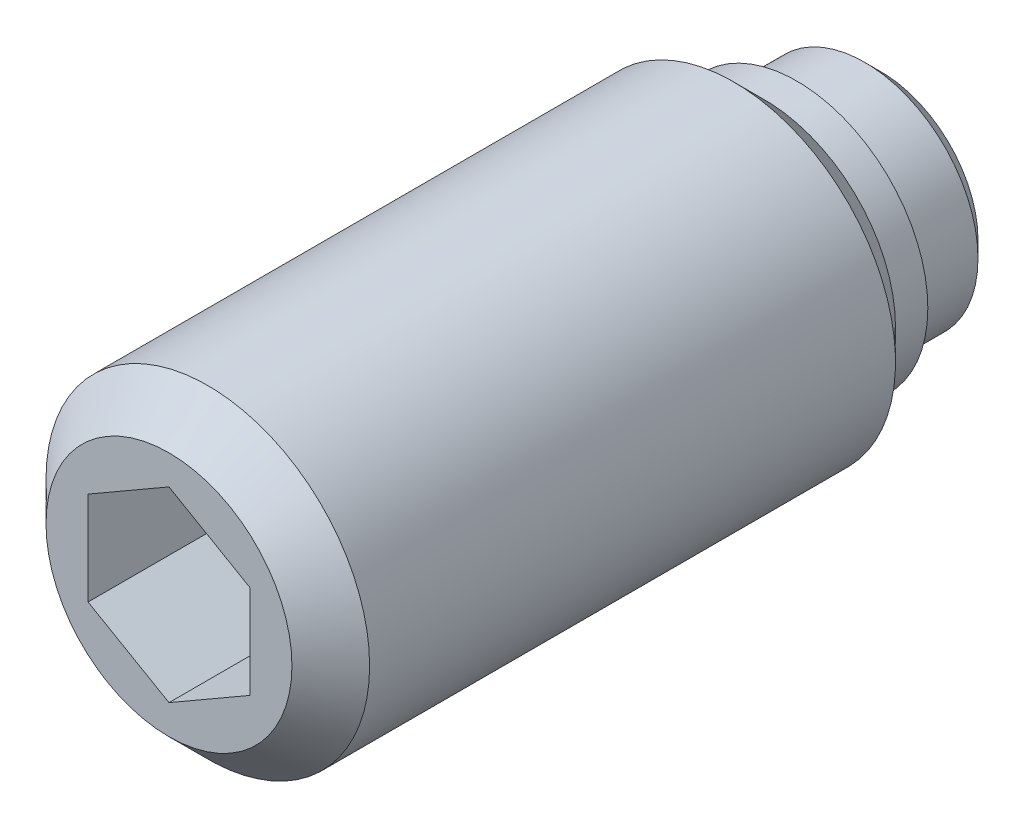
ISO-10303-21;
HEADER;
FILE_DESCRIPTION(('STEP AP214'),'2;1');
FILE_NAME('part.step','',(''),(''),'','','');
FILE_SCHEMA(('AUTOMOTIVE_DESIGN { 1 0 10303 214 1 1 1 1 }'));
ENDSEC;
DATA;
#1=APPLICATION_CONTEXT('core data for automotive mechanical design processes');
#2=APPLICATION_PROTOCOL_DEFINITION('international standard','automotive_design',2000,#1);
#3=PRODUCT_CONTEXT('',#1,'mechanical');
#4=PRODUCT('Part','Part','',(#3));
#5=PRODUCT_RELATED_PRODUCT_CATEGORY('part','',(#4));
#6=PRODUCT_DEFINITION_FORMATION('','',#4);
#7=PRODUCT_DEFINITION_CONTEXT('part definition',#1,'design');
#8=PRODUCT_DEFINITION('design','',#6,#7);
#9=PRODUCT_DEFINITION_SHAPE('','',#8);
#10=(LENGTH_UNIT() NAMED_UNIT(*) SI_UNIT(.MILLI.,.METRE.));
#11=(NAMED_UNIT(*) PLANE_ANGLE_UNIT() SI_UNIT($,.RADIAN.));
#12=(NAMED_UNIT(*) SI_UNIT($,.STERADIAN.) SOLID_ANGLE_UNIT());
#13=UNCERTAINTY_MEASURE_WITH_UNIT(LENGTH_MEASURE(1.E-05),#10,'distance_accuracy_value','');
#14=(GEOMETRIC_REPRESENTATION_CONTEXT(3) GLOBAL_UNCERTAINTY_ASSIGNED_CONTEXT((#13)) GLOBAL_UNIT_ASSIGNED_CONTEXT((#10,
#11,#12)) REPRESENTATION_CONTEXT('',''));
#15=CARTESIAN_POINT('',(0.,0.,0.));
#16=DIRECTION('',(0.,0.,1.));
#17=DIRECTION('',(1.,0.,0.));
#18=AXIS2_PLACEMENT_3D('',#15,#16,#17);
#19=CARTESIAN_POINT('',(0.,0.,2.6));
#20=DIRECTION('',(0.,0.,-1.));
#21=DIRECTION('',(-1.,0.,0.));
#22=AXIS2_PLACEMENT_3D('',#19,#20,#21);
#23=CYLINDRICAL_SURFACE('',#22,5.);
#24=CARTESIAN_POINT('',(0.,0.,20.8));
#25=DIRECTION('',(0.,0.,1.));
#26=DIRECTION('',(1.,0.,0.));
#27=AXIS2_PLACEMENT_3D('',#24,#25,#26);
#28=CIRCLE('',#27,5.);
#29=CARTESIAN_POINT('',(5.,0.,20.8));
#30=VERTEX_POINT('',#29);
#31=EDGE_CURVE('E9',#30,#30,#28,.F.);
#32=ORIENTED_EDGE('',*,*,#31,.T.);
#33=EDGE_LOOP('',(#32));
#34=FACE_BOUND('',#33,.T.);
#35=CARTESIAN_POINT('',(0.,0.,4.55));
#36=DIRECTION('',(0.,0.,-1.));
#37=DIRECTION('',(-1.,0.,0.));
#38=AXIS2_PLACEMENT_3D('',#35,#36,#37);
#39=CIRCLE('',#38,5.);
#40=CARTESIAN_POINT('',(-5.,0.,4.55));
#41=VERTEX_POINT('',#40);
#42=EDGE_CURVE('E74',#41,#41,#39,.T.);
#43=ORIENTED_EDGE('',*,*,#42,.F.);
#44=EDGE_LOOP('',(#43));
#45=FACE_BOUND('',#44,.T.);
#46=ADVANCED_FACE('F14',(#34,#45),#23,.T.);
#47=CARTESIAN_POINT('',(0.,0.,4.55));
#48=DIRECTION('',(0.,0.,1.));
#49=DIRECTION('',(1.,0.,0.));
#50=AXIS2_PLACEMENT_3D('',#47,#48,#49);
#51=CONICAL_SURFACE('',#50,5.,0.785398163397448);
#52=ORIENTED_EDGE('',*,*,#42,.T.);
#53=EDGE_LOOP('',(#52));
#54=FACE_BOUND('',#53,.T.);
#55=CARTESIAN_POINT('',(0.,0.,3.6));
#56=DIRECTION('',(0.,0.,-1.));
#57=DIRECTION('',(-1.,0.,0.));
#58=AXIS2_PLACEMENT_3D('',#55,#56,#57);
#59=CIRCLE('',#58,4.05);
#60=CARTESIAN_POINT('',(-4.05,0.,3.6));
#61=VERTEX_POINT('',#60);
#62=EDGE_CURVE('E112',#61,#61,#59,.T.);
#63=ORIENTED_EDGE('',*,*,#62,.F.);
#64=EDGE_LOOP('',(#63));
#65=FACE_BOUND('',#64,.T.);
#66=ADVANCED_FACE('F130',(#54,#65),#51,.T.);
#67=CARTESIAN_POINT('',(0.,0.,2.6));
#68=DIRECTION('',(0.,0.,-1.));
#69=DIRECTION('',(-1.,0.,0.));
#70=AXIS2_PLACEMENT_3D('',#67,#68,#69);
#71=CYLINDRICAL_SURFACE('',#70,4.05);
#72=ORIENTED_EDGE('',*,*,#62,.T.);
#73=EDGE_LOOP('',(#72));
#74=FACE_BOUND('',#73,.T.);
#75=CARTESIAN_POINT('',(0.,0.,2.6));
#76=DIRECTION('',(0.,0.,-1.));
#77=DIRECTION('',(-1.,0.,0.));
#78=AXIS2_PLACEMENT_3D('',#75,#76,#77);
#79=CIRCLE('',#78,4.05);
#80=CARTESIAN_POINT('',(-4.05,0.,2.6));
#81=VERTEX_POINT('',#80);
#82=EDGE_CURVE('E109',#81,#81,#79,.T.);
#83=ORIENTED_EDGE('',*,*,#82,.F.);
#84=EDGE_LOOP('',(#83));
#85=FACE_BOUND('',#84,.T.);
#86=ADVANCED_FACE('F135',(#74,#85),#71,.T.);
#87=CARTESIAN_POINT('',(0.,4.05,2.6));
#88=DIRECTION('',(0.,0.,1.));
#89=DIRECTION('',(1.,0.,0.));
#90=AXIS2_PLACEMENT_3D('',#87,#88,#89);
#91=PLANE('',#90);
#92=ORIENTED_EDGE('',*,*,#82,.T.);
#93=EDGE_LOOP('',(#92));
#94=FACE_BOUND('',#93,.T.);
#95=CARTESIAN_POINT('',(0.,0.,2.6));
#96=DIRECTION('',(0.,0.,-1.));
#97=DIRECTION('',(-1.,0.,0.));
#98=AXIS2_PLACEMENT_3D('',#95,#96,#97);
#99=CIRCLE('',#98,3.5);
#100=CARTESIAN_POINT('',(-3.5,0.,2.6));
#101=VERTEX_POINT('',#100);
#102=EDGE_CURVE('E106',#101,#101,#99,.T.);
#103=ORIENTED_EDGE('',*,*,#102,.F.);
#104=EDGE_LOOP('',(#103));
#105=FACE_BOUND('',#104,.T.);
#106=ADVANCED_FACE('F142',(#94,#105),#91,.F.);
#107=CARTESIAN_POINT('',(0.,0.,0.));
#108=DIRECTION('',(0.,0.,-1.));
#109=DIRECTION('',(-1.,0.,0.));
#110=AXIS2_PLACEMENT_3D('',#107,#108,#109);
#111=CYLINDRICAL_SURFACE('',#110,3.5);
#112=CARTESIAN_POINT('',(0.,0.,0.5));
#113=DIRECTION('',(0.,0.,-1.));
#114=DIRECTION('',(-1.,0.,0.));
#115=AXIS2_PLACEMENT_3D('',#112,#113,#114);
#116=CIRCLE('',#115,3.5);
#117=CARTESIAN_POINT('',(-3.5,0.,0.5));
#118=VERTEX_POINT('',#117);
#119=EDGE_CURVE('E103',#118,#118,#116,.T.);
#120=ORIENTED_EDGE('',*,*,#119,.F.);
#121=EDGE_LOOP('',(#120));
#122=FACE_BOUND('',#121,.T.);
#123=ORIENTED_EDGE('',*,*,#102,.T.);
#124=EDGE_LOOP('',(#123));
#125=FACE_BOUND('',#124,.T.);
#126=ADVANCED_FACE('F146',(#122,#125),#111,.T.);
#127=CARTESIAN_POINT('',(0.,0.,0.5));
#128=DIRECTION('',(0.,0.,1.));
#129=DIRECTION('',(1.,0.,0.));
#130=AXIS2_PLACEMENT_3D('',#127,#128,#129);
#131=CONICAL_SURFACE('',#130,3.5,0.785398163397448);
#132=CARTESIAN_POINT('',(0.,0.,0.));
#133=DIRECTION('',(0.,0.,-1.));
#134=DIRECTION('',(-1.,0.,0.));
#135=AXIS2_PLACEMENT_3D('',#132,#133,#134);
#136=CIRCLE('',#135,3.);
#137=CARTESIAN_POINT('',(-3.,0.,0.));
#138=VERTEX_POINT('',#137);
#139=EDGE_CURVE('E100',#138,#138,#136,.T.);
#140=ORIENTED_EDGE('',*,*,#139,.F.);
#141=EDGE_LOOP('',(#140));
#142=FACE_BOUND('',#141,.T.);
#143=ORIENTED_EDGE('',*,*,#119,.T.);
#144=EDGE_LOOP('',(#143));
#145=FACE_BOUND('',#144,.T.);
#146=ADVANCED_FACE('F150',(#142,#145),#131,.T.);
#147=CARTESIAN_POINT('',(0.,3.,0.));
#148=DIRECTION('',(0.,0.,1.));
#149=DIRECTION('',(1.,0.,0.));
#150=AXIS2_PLACEMENT_3D('',#147,#148,#149);
#151=PLANE('',#150);
#152=ORIENTED_EDGE('',*,*,#139,.T.);
#153=EDGE_LOOP('',(#152));
#154=FACE_BOUND('',#153,.T.);
#155=ADVANCED_FACE('F154',(#154),#151,.F.);
#156=CARTESIAN_POINT('',(0.,0.,22.));
#157=DIRECTION('',(0.,0.,1.));
#158=DIRECTION('',(1.,0.,0.));
#159=AXIS2_PLACEMENT_3D('',#156,#157,#158);
#160=PLANE('',#159);
#161=CARTESIAN_POINT('',(0.,0.,22.));
#162=DIRECTION('',(0.,0.,1.));
#163=DIRECTION('',(1.,0.,0.));
#164=AXIS2_PLACEMENT_3D('',#161,#162,#163);
#165=CIRCLE('',#164,3.8);
#166=CARTESIAN_POINT('',(3.8,0.,22.));
#167=VERTEX_POINT('',#166);
#168=EDGE_CURVE('E22',#167,#167,#165,.T.);
#169=ORIENTED_EDGE('',*,*,#168,.T.);
#170=EDGE_LOOP('',(#169));
#171=FACE_BOUND('',#170,.T.);
#172=DIRECTION('',(-0.866025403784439,0.5,0.));
#173=VECTOR('',#172,1.);
#174=CARTESIAN_POINT('',(-2.5,-1.44337567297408,22.));
#175=LINE('',#174,#173);
#176=CARTESIAN_POINT('',(0.,-2.88675134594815,22.));
#177=VERTEX_POINT('',#176);
#178=CARTESIAN_POINT('',(-2.5,-1.44337567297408,22.));
#179=VERTEX_POINT('',#178);
#180=EDGE_CURVE('E69',#177,#179,#175,.T.);
#181=ORIENTED_EDGE('',*,*,#180,.T.);
#182=DIRECTION('',(0.,1.,0.));
#183=VECTOR('',#182,1.);
#184=CARTESIAN_POINT('',(-2.5,1.44337567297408,22.));
#185=LINE('',#184,#183);
#186=CARTESIAN_POINT('',(-2.5,1.44337567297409,22.));
#187=VERTEX_POINT('',#186);
#188=EDGE_CURVE('E84',#179,#187,#185,.T.);
#189=ORIENTED_EDGE('',*,*,#188,.T.);
#190=DIRECTION('',(0.866025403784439,0.5,0.));
#191=VECTOR('',#190,1.);
#192=CARTESIAN_POINT('',(0.,2.88675134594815,22.));
#193=LINE('',#192,#191);
#194=CARTESIAN_POINT('',(0.,2.88675134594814,22.));
#195=VERTEX_POINT('',#194);
#196=EDGE_CURVE('E301',#187,#195,#193,.T.);
#197=ORIENTED_EDGE('',*,*,#196,.T.);
#198=DIRECTION('',(0.866025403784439,-0.5,0.));
#199=VECTOR('',#198,1.);
#200=CARTESIAN_POINT('',(2.5,1.44337567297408,22.));
#201=LINE('',#200,#199);
#202=CARTESIAN_POINT('',(2.5,1.44337567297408,22.));
#203=VERTEX_POINT('',#202);
#204=EDGE_CURVE('E298',#195,#203,#201,.T.);
#205=ORIENTED_EDGE('',*,*,#204,.T.);
#206=DIRECTION('',(0.,-1.,0.));
#207=VECTOR('',#206,1.);
#208=CARTESIAN_POINT('',(2.5,-1.44337567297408,22.));
#209=LINE('',#208,#207);
#210=CARTESIAN_POINT('',(2.5,-1.44337567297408,22.));
#211=VERTEX_POINT('',#210);
#212=EDGE_CURVE('E29',#203,#211,#209,.T.);
#213=ORIENTED_EDGE('',*,*,#212,.T.);
#214=DIRECTION('',(-0.866025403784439,-0.5,0.));
#215=VECTOR('',#214,1.);
#216=CARTESIAN_POINT('',(0.,-2.88675134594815,22.));
#217=LINE('',#216,#215);
#218=EDGE_CURVE('E66',#211,#177,#217,.T.);
#219=ORIENTED_EDGE('',*,*,#218,.T.);
#220=EDGE_LOOP('',(#181,#189,#197,#205,#213,#219));
#221=FACE_BOUND('',#220,.T.);
#222=ADVANCED_FACE('F68',(#171,#221),#160,.T.);
#223=CARTESIAN_POINT('',(0.,0.,16.));
#224=DIRECTION('',(0.,0.,1.));
#225=DIRECTION('',(1.,0.,0.));
#226=AXIS2_PLACEMENT_3D('',#223,#224,#225);
#227=PLANE('',#226);
#228=DIRECTION('',(0.,-1.,0.));
#229=VECTOR('',#228,1.);
#230=CARTESIAN_POINT('',(-2.5,1.44337567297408,16.));
#231=LINE('',#230,#229);
#232=CARTESIAN_POINT('',(-2.5,1.44337567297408,16.));
#233=VERTEX_POINT('',#232);
#234=CARTESIAN_POINT('',(-2.5,-1.44337567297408,16.));
#235=VERTEX_POINT('',#234);
#236=EDGE_CURVE('E83',#233,#235,#231,.T.);
#237=ORIENTED_EDGE('',*,*,#236,.T.);
#238=DIRECTION('',(0.866025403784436,-0.5,0.));
#239=VECTOR('',#238,1.);
#240=CARTESIAN_POINT('',(-2.5,-1.44337567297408,16.));
#241=LINE('',#240,#239);
#242=CARTESIAN_POINT('',(0.,-2.88675134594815,16.));
#243=VERTEX_POINT('',#242);
#244=EDGE_CURVE('E280',#235,#243,#241,.T.);
#245=ORIENTED_EDGE('',*,*,#244,.T.);
#246=DIRECTION('',(0.866025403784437,0.5,0.));
#247=VECTOR('',#246,1.);
#248=CARTESIAN_POINT('',(0.,-2.88675134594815,16.));
#249=LINE('',#248,#247);
#250=CARTESIAN_POINT('',(2.5,-1.44337567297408,16.));
#251=VERTEX_POINT('',#250);
#252=EDGE_CURVE('E88',#243,#251,#249,.T.);
#253=ORIENTED_EDGE('',*,*,#252,.T.);
#254=DIRECTION('',(0.,1.,0.));
#255=VECTOR('',#254,1.);
#256=CARTESIAN_POINT('',(2.5,-1.44337567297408,16.));
#257=LINE('',#256,#255);
#258=CARTESIAN_POINT('',(2.5,1.44337567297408,16.));
#259=VERTEX_POINT('',#258);
#260=EDGE_CURVE('E287',#251,#259,#257,.T.);
#261=ORIENTED_EDGE('',*,*,#260,.T.);
#262=DIRECTION('',(-0.866025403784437,0.5,0.));
#263=VECTOR('',#262,1.);
#264=CARTESIAN_POINT('',(2.5,1.44337567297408,16.));
#265=LINE('',#264,#263);
#266=CARTESIAN_POINT('',(0.,2.88675134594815,16.));
#267=VERTEX_POINT('',#266);
#268=EDGE_CURVE('E96',#259,#267,#265,.T.);
#269=ORIENTED_EDGE('',*,*,#268,.T.);
#270=DIRECTION('',(-0.866025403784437,-0.5,0.));
#271=VECTOR('',#270,1.);
#272=CARTESIAN_POINT('',(0.,2.88675134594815,16.));
#273=LINE('',#272,#271);
#274=EDGE_CURVE('E91',#267,#233,#273,.T.);
#275=ORIENTED_EDGE('',*,*,#274,.T.);
#276=EDGE_LOOP('',(#237,#245,#253,#261,#269,#275));
#277=FACE_BOUND('',#276,.T.);
#278=ADVANCED_FACE('F162',(#277),#227,.T.);
#279=CARTESIAN_POINT('',(0.,-2.88675134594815,21.));
#280=DIRECTION('',(0.5,-0.866025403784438,0.));
#281=DIRECTION('',(0.866025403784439,0.5,0.));
#282=AXIS2_PLACEMENT_3D('',#279,#280,#281);
#283=PLANE('',#282);
#284=ORIENTED_EDGE('',*,*,#218,.F.);
#285=DIRECTION('',(0.,0.,1.));
#286=VECTOR('',#285,1.);
#287=CARTESIAN_POINT('',(2.5,-1.44337567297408,21.));
#288=LINE('',#287,#286);
#289=EDGE_CURVE('E90',#251,#211,#288,.T.);
#290=ORIENTED_EDGE('',*,*,#289,.F.);
#291=ORIENTED_EDGE('',*,*,#252,.F.);
#292=DIRECTION('',(0.,0.,1.));
#293=VECTOR('',#292,1.);
#294=CARTESIAN_POINT('',(0.,-2.88675134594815,21.));
#295=LINE('',#294,#293);
#296=EDGE_CURVE('E80',#243,#177,#295,.T.);
#297=ORIENTED_EDGE('',*,*,#296,.T.);
#298=EDGE_LOOP('',(#284,#290,#291,#297));
#299=FACE_BOUND('',#298,.T.);
#300=ADVANCED_FACE('F86',(#299),#283,.F.);
#301=CARTESIAN_POINT('',(2.5,-1.44337567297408,21.));
#302=DIRECTION('',(1.,0.,0.));
#303=DIRECTION('',(0.,0.,-1.));
#304=AXIS2_PLACEMENT_3D('',#301,#302,#303);
#305=PLANE('',#304);
#306=ORIENTED_EDGE('',*,*,#212,.F.);
#307=DIRECTION('',(0.,0.,1.));
#308=VECTOR('',#307,1.);
#309=CARTESIAN_POINT('',(2.5,1.44337567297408,21.));
#310=LINE('',#309,#308);
#311=EDGE_CURVE('E93',#259,#203,#310,.T.);
#312=ORIENTED_EDGE('',*,*,#311,.F.);
#313=ORIENTED_EDGE('',*,*,#260,.F.);
#314=ORIENTED_EDGE('',*,*,#289,.T.);
#315=EDGE_LOOP('',(#306,#312,#313,#314));
#316=FACE_BOUND('',#315,.T.);
#317=ADVANCED_FACE('F161',(#316),#305,.F.);
#318=CARTESIAN_POINT('',(2.5,1.44337567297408,21.));
#319=DIRECTION('',(0.5,0.866025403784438,0.));
#320=DIRECTION('',(-0.866025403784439,0.5,0.));
#321=AXIS2_PLACEMENT_3D('',#318,#319,#320);
#322=PLANE('',#321);
#323=ORIENTED_EDGE('',*,*,#204,.F.);
#324=DIRECTION('',(0.,0.,1.));
#325=VECTOR('',#324,1.);
#326=CARTESIAN_POINT('',(0.,2.88675134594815,21.));
#327=LINE('',#326,#325);
#328=EDGE_CURVE('E293',#267,#195,#327,.T.);
#329=ORIENTED_EDGE('',*,*,#328,.F.);
#330=ORIENTED_EDGE('',*,*,#268,.F.);
#331=ORIENTED_EDGE('',*,*,#311,.T.);
#332=EDGE_LOOP('',(#323,#329,#330,#331));
#333=FACE_BOUND('',#332,.T.);
#334=ADVANCED_FACE('F165',(#333),#322,.F.);
#335=CARTESIAN_POINT('',(0.,2.88675134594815,21.));
#336=DIRECTION('',(-0.5,0.866025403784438,0.));
#337=DIRECTION('',(-0.866025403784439,-0.5,0.));
#338=AXIS2_PLACEMENT_3D('',#335,#336,#337);
#339=PLANE('',#338);
#340=ORIENTED_EDGE('',*,*,#196,.F.);
#341=DIRECTION('',(0.,0.,1.));
#342=VECTOR('',#341,1.);
#343=CARTESIAN_POINT('',(-2.5,1.44337567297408,21.));
#344=LINE('',#343,#342);
#345=EDGE_CURVE('E37',#233,#187,#344,.T.);
#346=ORIENTED_EDGE('',*,*,#345,.F.);
#347=ORIENTED_EDGE('',*,*,#274,.F.);
#348=ORIENTED_EDGE('',*,*,#328,.T.);
#349=EDGE_LOOP('',(#340,#346,#347,#348));
#350=FACE_BOUND('',#349,.T.);
#351=ADVANCED_FACE('F169',(#350),#339,.F.);
#352=CARTESIAN_POINT('',(-2.5,1.44337567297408,21.));
#353=DIRECTION('',(-1.,0.,0.));
#354=DIRECTION('',(0.,0.,1.));
#355=AXIS2_PLACEMENT_3D('',#352,#353,#354);
#356=PLANE('',#355);
#357=ORIENTED_EDGE('',*,*,#188,.F.);
#358=DIRECTION('',(0.,0.,1.));
#359=VECTOR('',#358,1.);
#360=CARTESIAN_POINT('',(-2.5,-1.44337567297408,21.));
#361=LINE('',#360,#359);
#362=EDGE_CURVE('E82',#235,#179,#361,.T.);
#363=ORIENTED_EDGE('',*,*,#362,.F.);
#364=ORIENTED_EDGE('',*,*,#236,.F.);
#365=ORIENTED_EDGE('',*,*,#345,.T.);
#366=EDGE_LOOP('',(#357,#363,#364,#365));
#367=FACE_BOUND('',#366,.T.);
#368=ADVANCED_FACE('F126',(#367),#356,.F.);
#369=CARTESIAN_POINT('',(-2.5,-1.44337567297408,21.));
#370=DIRECTION('',(-0.5,-0.866025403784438,0.));
#371=DIRECTION('',(0.866025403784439,-0.5,0.));
#372=AXIS2_PLACEMENT_3D('',#369,#370,#371);
#373=PLANE('',#372);
#374=ORIENTED_EDGE('',*,*,#180,.F.);
#375=ORIENTED_EDGE('',*,*,#296,.F.);
#376=ORIENTED_EDGE('',*,*,#244,.F.);
#377=ORIENTED_EDGE('',*,*,#362,.T.);
#378=EDGE_LOOP('',(#374,#375,#376,#377));
#379=FACE_BOUND('',#378,.T.);
#380=ADVANCED_FACE('F78',(#379),#373,.F.);
#381=CARTESIAN_POINT('',(0.,0.,22.));
#382=DIRECTION('',(0.,0.,-1.));
#383=DIRECTION('',(-1.,0.,0.));
#384=AXIS2_PLACEMENT_3D('',#381,#382,#383);
#385=CONICAL_SURFACE('',#384,3.8,0.785398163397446);
#386=ORIENTED_EDGE('',*,*,#31,.F.);
#387=EDGE_LOOP('',(#386));
#388=FACE_BOUND('',#387,.T.);
#389=ORIENTED_EDGE('',*,*,#168,.F.);
#390=EDGE_LOOP('',(#389));
#391=FACE_BOUND('',#390,.T.);
#392=ADVANCED_FACE('F16',(#388,#391),#385,.T.);
#393=CLOSED_SHELL('',(#46,#66,#86,#106,#126,#146,#155,#222,#278,#300,#317,#334,#351,#368,#380,#392));
#394=MANIFOLD_SOLID_BREP('B1',#393);
#395=ADVANCED_BREP_SHAPE_REPRESENTATION('',(#18,#394),#14);
#396=SHAPE_DEFINITION_REPRESENTATION(#9,#395);
ENDSEC;
END-ISO-10303-21;
